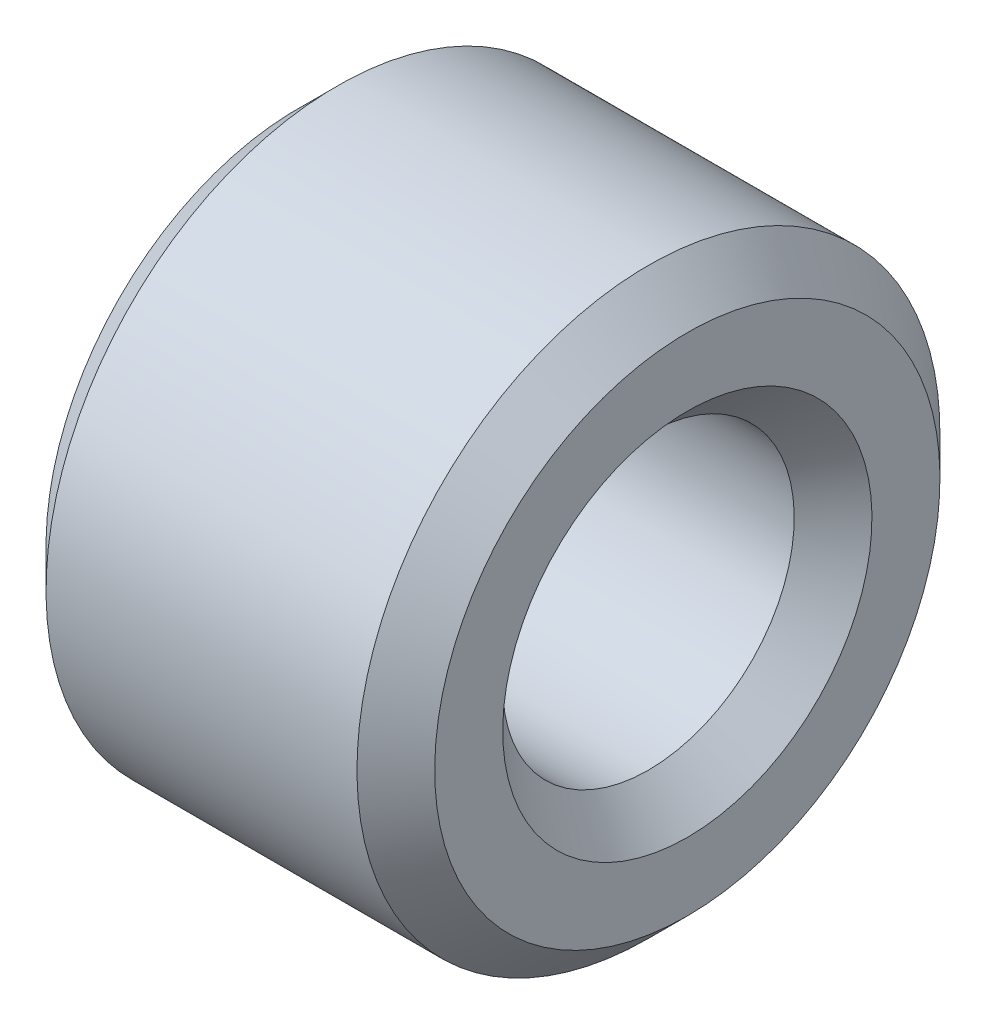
ISO-10303-21;
HEADER;
FILE_DESCRIPTION(('STEP AP214'),'2;1');
FILE_NAME('part.step','',(''),(''),'','','');
FILE_SCHEMA(('AUTOMOTIVE_DESIGN { 1 0 10303 214 1 1 1 1 }'));
ENDSEC;
DATA;
#1=APPLICATION_CONTEXT('core data for automotive mechanical design processes');
#2=APPLICATION_PROTOCOL_DEFINITION('international standard','automotive_design',2000,#1);
#3=PRODUCT_CONTEXT('',#1,'mechanical');
#4=PRODUCT('Part','Part','',(#3));
#5=PRODUCT_RELATED_PRODUCT_CATEGORY('part','',(#4));
#6=PRODUCT_DEFINITION_FORMATION('','',#4);
#7=PRODUCT_DEFINITION_CONTEXT('part definition',#1,'design');
#8=PRODUCT_DEFINITION('design','',#6,#7);
#9=PRODUCT_DEFINITION_SHAPE('','',#8);
#10=(LENGTH_UNIT() NAMED_UNIT(*) SI_UNIT(.MILLI.,.METRE.));
#11=(NAMED_UNIT(*) PLANE_ANGLE_UNIT() SI_UNIT($,.RADIAN.));
#12=(NAMED_UNIT(*) SI_UNIT($,.STERADIAN.) SOLID_ANGLE_UNIT());
#13=UNCERTAINTY_MEASURE_WITH_UNIT(LENGTH_MEASURE(1.E-05),#10,'distance_accuracy_value','');
#14=(GEOMETRIC_REPRESENTATION_CONTEXT(3) GLOBAL_UNCERTAINTY_ASSIGNED_CONTEXT((#13)) GLOBAL_UNIT_ASSIGNED_CONTEXT((#10,
#11,#12)) REPRESENTATION_CONTEXT('',''));
#15=CARTESIAN_POINT('',(0.,0.,0.));
#16=DIRECTION('',(0.,0.,1.));
#17=DIRECTION('',(1.,0.,0.));
#18=AXIS2_PLACEMENT_3D('',#15,#16,#17);
#19=CARTESIAN_POINT('',(0.,-2.25,0.));
#20=DIRECTION('',(-1.,0.,0.));
#21=DIRECTION('',(0.,1.,0.));
#22=AXIS2_PLACEMENT_3D('',#19,#20,#21);
#23=PLANE('',#22);
#24=CARTESIAN_POINT('',(0.,0.,0.));
#25=DIRECTION('',(1.,0.,0.));
#26=DIRECTION('',(0.,-1.,0.));
#27=AXIS2_PLACEMENT_3D('',#24,#25,#26);
#28=CIRCLE('',#27,1.9);
#29=CARTESIAN_POINT('',(0.,-1.9,0.));
#30=VERTEX_POINT('',#29);
#31=EDGE_CURVE('E9',#30,#30,#28,.T.);
#32=ORIENTED_EDGE('',*,*,#31,.T.);
#33=EDGE_LOOP('',(#32));
#34=FACE_BOUND('',#33,.T.);
#35=CARTESIAN_POINT('',(0.,0.,0.));
#36=DIRECTION('',(1.,0.,0.));
#37=DIRECTION('',(0.,-1.,0.));
#38=AXIS2_PLACEMENT_3D('',#35,#36,#37);
#39=CIRCLE('',#38,2.6);
#40=CARTESIAN_POINT('',(0.,-2.6,0.));
#41=VERTEX_POINT('',#40);
#42=EDGE_CURVE('E53',#41,#41,#39,.T.);
#43=ORIENTED_EDGE('',*,*,#42,.F.);
#44=EDGE_LOOP('',(#43));
#45=FACE_BOUND('',#44,.T.);
#46=ADVANCED_FACE('F15',(#34,#45),#23,.T.);
#47=CARTESIAN_POINT('',(0.2,0.,0.));
#48=DIRECTION('',(-1.,0.,0.));
#49=DIRECTION('',(0.,-1.,0.));
#50=AXIS2_PLACEMENT_3D('',#47,#48,#49);
#51=CONICAL_SURFACE('',#50,1.7,0.785398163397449);
#52=CARTESIAN_POINT('',(0.4,0.,0.));
#53=DIRECTION('',(1.,0.,0.));
#54=DIRECTION('',(0.,-1.,0.));
#55=AXIS2_PLACEMENT_3D('',#52,#53,#54);
#56=CIRCLE('',#55,1.5);
#57=CARTESIAN_POINT('',(0.4,-1.5,0.));
#58=VERTEX_POINT('',#57);
#59=EDGE_CURVE('E22',#58,#58,#56,.T.);
#60=ORIENTED_EDGE('',*,*,#59,.T.);
#61=EDGE_LOOP('',(#60));
#62=FACE_BOUND('',#61,.T.);
#63=ORIENTED_EDGE('',*,*,#31,.F.);
#64=EDGE_LOOP('',(#63));
#65=FACE_BOUND('',#64,.T.);
#66=ADVANCED_FACE('F82',(#62,#65),#51,.F.);
#67=CARTESIAN_POINT('',(2.,0.,0.));
#68=DIRECTION('',(-1.,0.,0.));
#69=DIRECTION('',(0.,-1.,0.));
#70=AXIS2_PLACEMENT_3D('',#67,#68,#69);
#71=CYLINDRICAL_SURFACE('',#70,1.5);
#72=CARTESIAN_POINT('',(3.6,0.,0.));
#73=DIRECTION('',(1.,0.,0.));
#74=DIRECTION('',(0.,-1.,0.));
#75=AXIS2_PLACEMENT_3D('',#72,#73,#74);
#76=CIRCLE('',#75,1.5);
#77=CARTESIAN_POINT('',(3.6,-1.5,0.));
#78=VERTEX_POINT('',#77);
#79=EDGE_CURVE('E58',#78,#78,#76,.T.);
#80=ORIENTED_EDGE('',*,*,#79,.T.);
#81=EDGE_LOOP('',(#80));
#82=FACE_BOUND('',#81,.T.);
#83=ORIENTED_EDGE('',*,*,#59,.F.);
#84=EDGE_LOOP('',(#83));
#85=FACE_BOUND('',#84,.T.);
#86=ADVANCED_FACE('F66',(#82,#85),#71,.F.);
#87=CARTESIAN_POINT('',(3.8,0.,0.));
#88=DIRECTION('',(1.,0.,0.));
#89=DIRECTION('',(0.,-1.,0.));
#90=AXIS2_PLACEMENT_3D('',#87,#88,#89);
#91=CONICAL_SURFACE('',#90,1.7,0.78539816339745);
#92=CARTESIAN_POINT('',(4.,0.,0.));
#93=DIRECTION('',(1.,0.,0.));
#94=DIRECTION('',(0.,-1.,0.));
#95=AXIS2_PLACEMENT_3D('',#92,#93,#94);
#96=CIRCLE('',#95,1.9);
#97=CARTESIAN_POINT('',(4.,-1.9,0.));
#98=VERTEX_POINT('',#97);
#99=EDGE_CURVE('E63',#98,#98,#96,.T.);
#100=ORIENTED_EDGE('',*,*,#99,.T.);
#101=EDGE_LOOP('',(#100));
#102=FACE_BOUND('',#101,.T.);
#103=ORIENTED_EDGE('',*,*,#79,.F.);
#104=EDGE_LOOP('',(#103));
#105=FACE_BOUND('',#104,.T.);
#106=ADVANCED_FACE('F69',(#102,#105),#91,.F.);
#107=CARTESIAN_POINT('',(4.,-2.25,0.));
#108=DIRECTION('',(1.,0.,0.));
#109=DIRECTION('',(0.,-1.,0.));
#110=AXIS2_PLACEMENT_3D('',#107,#108,#109);
#111=PLANE('',#110);
#112=CARTESIAN_POINT('',(4.,0.,0.));
#113=DIRECTION('',(1.,0.,0.));
#114=DIRECTION('',(0.,-1.,0.));
#115=AXIS2_PLACEMENT_3D('',#112,#113,#114);
#116=CIRCLE('',#115,2.6);
#117=CARTESIAN_POINT('',(4.,-2.6,0.));
#118=VERTEX_POINT('',#117);
#119=EDGE_CURVE('E61',#118,#118,#116,.T.);
#120=ORIENTED_EDGE('',*,*,#119,.T.);
#121=EDGE_LOOP('',(#120));
#122=FACE_BOUND('',#121,.T.);
#123=ORIENTED_EDGE('',*,*,#99,.F.);
#124=EDGE_LOOP('',(#123));
#125=FACE_BOUND('',#124,.T.);
#126=ADVANCED_FACE('F71',(#122,#125),#111,.T.);
#127=CARTESIAN_POINT('',(3.8,0.,0.));
#128=DIRECTION('',(-1.,0.,0.));
#129=DIRECTION('',(0.,-1.,0.));
#130=AXIS2_PLACEMENT_3D('',#127,#128,#129);
#131=CONICAL_SURFACE('',#130,2.8,0.785398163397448);
#132=CARTESIAN_POINT('',(3.6,0.,0.));
#133=DIRECTION('',(1.,0.,0.));
#134=DIRECTION('',(0.,-1.,0.));
#135=AXIS2_PLACEMENT_3D('',#132,#133,#134);
#136=CIRCLE('',#135,3.);
#137=CARTESIAN_POINT('',(3.6,-3.,0.));
#138=VERTEX_POINT('',#137);
#139=EDGE_CURVE('E55',#138,#138,#136,.T.);
#140=ORIENTED_EDGE('',*,*,#139,.T.);
#141=EDGE_LOOP('',(#140));
#142=FACE_BOUND('',#141,.T.);
#143=ORIENTED_EDGE('',*,*,#119,.F.);
#144=EDGE_LOOP('',(#143));
#145=FACE_BOUND('',#144,.T.);
#146=ADVANCED_FACE('F79',(#142,#145),#131,.T.);
#147=CARTESIAN_POINT('',(2.,0.,0.));
#148=DIRECTION('',(-1.,0.,0.));
#149=DIRECTION('',(0.,-1.,0.));
#150=AXIS2_PLACEMENT_3D('',#147,#148,#149);
#151=CYLINDRICAL_SURFACE('',#150,3.);
#152=CARTESIAN_POINT('',(0.4,0.,0.));
#153=DIRECTION('',(1.,0.,0.));
#154=DIRECTION('',(0.,-1.,0.));
#155=AXIS2_PLACEMENT_3D('',#152,#153,#154);
#156=CIRCLE('',#155,3.);
#157=CARTESIAN_POINT('',(0.4,-3.,0.));
#158=VERTEX_POINT('',#157);
#159=EDGE_CURVE('E49',#158,#158,#156,.T.);
#160=ORIENTED_EDGE('',*,*,#159,.T.);
#161=EDGE_LOOP('',(#160));
#162=FACE_BOUND('',#161,.T.);
#163=ORIENTED_EDGE('',*,*,#139,.F.);
#164=EDGE_LOOP('',(#163));
#165=FACE_BOUND('',#164,.T.);
#166=ADVANCED_FACE('F50',(#162,#165),#151,.T.);
#167=CARTESIAN_POINT('',(0.2,0.,0.));
#168=DIRECTION('',(1.,0.,0.));
#169=DIRECTION('',(0.,-1.,0.));
#170=AXIS2_PLACEMENT_3D('',#167,#168,#169);
#171=CONICAL_SURFACE('',#170,2.8,0.785398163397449);
#172=ORIENTED_EDGE('',*,*,#42,.T.);
#173=EDGE_LOOP('',(#172));
#174=FACE_BOUND('',#173,.T.);
#175=ORIENTED_EDGE('',*,*,#159,.F.);
#176=EDGE_LOOP('',(#175));
#177=FACE_BOUND('',#176,.T.);
#178=ADVANCED_FACE('F92',(#174,#177),#171,.T.);
#179=CLOSED_SHELL('',(#46,#66,#86,#106,#126,#146,#166,#178));
#180=MANIFOLD_SOLID_BREP('B1',#179);
#181=ADVANCED_BREP_SHAPE_REPRESENTATION('',(#18,#180),#14);
#182=SHAPE_DEFINITION_REPRESENTATION(#9,#181);
ENDSEC;
END-ISO-10303-21;
